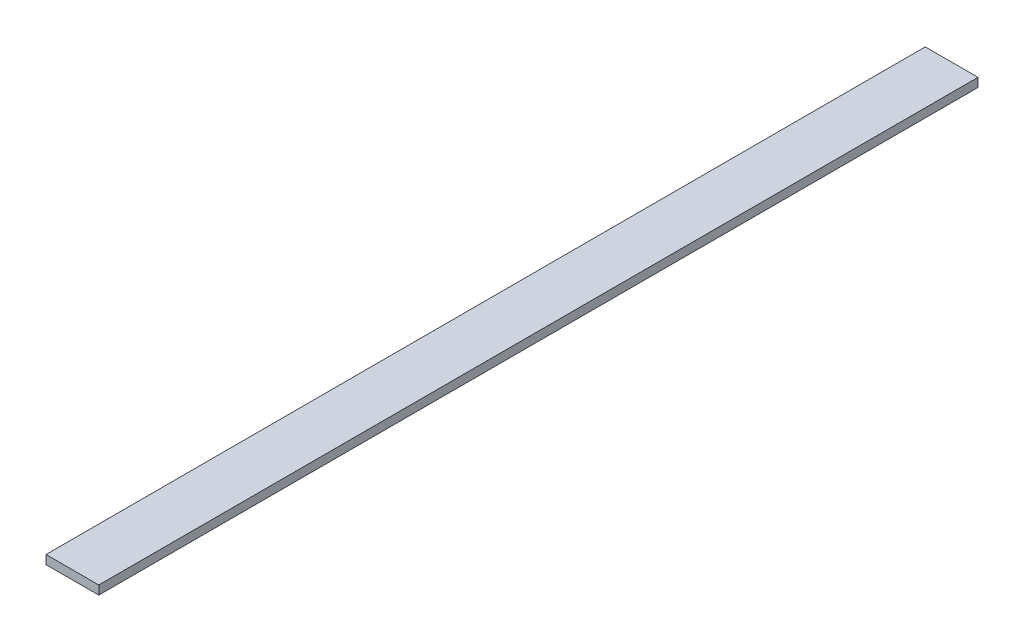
ISO-10303-21;
HEADER;
FILE_DESCRIPTION(('STEP AP214'),'2;1');
FILE_NAME('part.step','',(''),(''),'','','');
FILE_SCHEMA(('AUTOMOTIVE_DESIGN { 1 0 10303 214 1 1 1 1 }'));
ENDSEC;
DATA;
#1=APPLICATION_CONTEXT('core data for automotive mechanical design processes');
#2=APPLICATION_PROTOCOL_DEFINITION('international standard','automotive_design',2000,#1);
#3=PRODUCT_CONTEXT('',#1,'mechanical');
#4=PRODUCT('Part','Part','',(#3));
#5=PRODUCT_RELATED_PRODUCT_CATEGORY('part','',(#4));
#6=PRODUCT_DEFINITION_FORMATION('','',#4);
#7=PRODUCT_DEFINITION_CONTEXT('part definition',#1,'design');
#8=PRODUCT_DEFINITION('design','',#6,#7);
#9=PRODUCT_DEFINITION_SHAPE('','',#8);
#10=(LENGTH_UNIT() NAMED_UNIT(*) SI_UNIT(.MILLI.,.METRE.));
#11=(NAMED_UNIT(*) PLANE_ANGLE_UNIT() SI_UNIT($,.RADIAN.));
#12=(NAMED_UNIT(*) SI_UNIT($,.STERADIAN.) SOLID_ANGLE_UNIT());
#13=UNCERTAINTY_MEASURE_WITH_UNIT(LENGTH_MEASURE(1.E-05),#10,'distance_accuracy_value','');
#14=(GEOMETRIC_REPRESENTATION_CONTEXT(3) GLOBAL_UNCERTAINTY_ASSIGNED_CONTEXT((#13)) GLOBAL_UNIT_ASSIGNED_CONTEXT((#10,
#11,#12)) REPRESENTATION_CONTEXT('',''));
#15=CARTESIAN_POINT('',(0.,0.,0.));
#16=DIRECTION('',(0.,0.,1.));
#17=DIRECTION('',(1.,0.,0.));
#18=AXIS2_PLACEMENT_3D('',#15,#16,#17);
#19=CARTESIAN_POINT('',(15.,0.,0.));
#20=DIRECTION('',(-1.,0.,0.));
#21=DIRECTION('',(0.,0.,1.));
#22=AXIS2_PLACEMENT_3D('',#19,#20,#21);
#23=PLANE('',#22);
#24=DIRECTION('',(0.,-1.,0.));
#25=VECTOR('',#24,1.);
#26=CARTESIAN_POINT('',(15.,2.5,0.));
#27=LINE('',#26,#25);
#28=CARTESIAN_POINT('',(15.,5.,0.));
#29=VERTEX_POINT('',#28);
#30=CARTESIAN_POINT('',(15.,0.,0.));
#31=VERTEX_POINT('',#30);
#32=EDGE_CURVE('E51',#29,#31,#27,.T.);
#33=ORIENTED_EDGE('',*,*,#32,.F.);
#34=DIRECTION('',(0.,0.,-1.));
#35=VECTOR('',#34,1.);
#36=CARTESIAN_POINT('',(15.,5.,250.));
#37=LINE('',#36,#35);
#38=CARTESIAN_POINT('',(15.,5.,500.));
#39=VERTEX_POINT('',#38);
#40=EDGE_CURVE('E66',#39,#29,#37,.T.);
#41=ORIENTED_EDGE('',*,*,#40,.F.);
#42=DIRECTION('',(0.,-1.,0.));
#43=VECTOR('',#42,1.);
#44=CARTESIAN_POINT('',(15.,2.5,500.));
#45=LINE('',#44,#43);
#46=CARTESIAN_POINT('',(15.,0.,500.));
#47=VERTEX_POINT('',#46);
#48=EDGE_CURVE('E18',#39,#47,#45,.T.);
#49=ORIENTED_EDGE('',*,*,#48,.T.);
#50=DIRECTION('',(0.,0.,1.));
#51=VECTOR('',#50,1.);
#52=CARTESIAN_POINT('',(15.,0.,250.));
#53=LINE('',#52,#51);
#54=EDGE_CURVE('E56',#31,#47,#53,.T.);
#55=ORIENTED_EDGE('',*,*,#54,.F.);
#56=EDGE_LOOP('',(#33,#41,#49,#55));
#57=FACE_BOUND('',#56,.T.);
#58=ADVANCED_FACE('F14',(#57),#23,.F.);
#59=CARTESIAN_POINT('',(15.,0.,500.));
#60=DIRECTION('',(0.,0.,-1.));
#61=DIRECTION('',(-1.,0.,0.));
#62=AXIS2_PLACEMENT_3D('',#59,#60,#61);
#63=PLANE('',#62);
#64=DIRECTION('',(-1.,0.,0.));
#65=VECTOR('',#64,1.);
#66=CARTESIAN_POINT('',(0.,0.,500.));
#67=LINE('',#66,#65);
#68=CARTESIAN_POINT('',(-15.,0.,500.));
#69=VERTEX_POINT('',#68);
#70=EDGE_CURVE('E61',#47,#69,#67,.T.);
#71=ORIENTED_EDGE('',*,*,#70,.F.);
#72=ORIENTED_EDGE('',*,*,#48,.F.);
#73=DIRECTION('',(1.,0.,0.));
#74=VECTOR('',#73,1.);
#75=CARTESIAN_POINT('',(0.,5.,500.));
#76=LINE('',#75,#74);
#77=CARTESIAN_POINT('',(-15.,5.,500.));
#78=VERTEX_POINT('',#77);
#79=EDGE_CURVE('E79',#78,#39,#76,.T.);
#80=ORIENTED_EDGE('',*,*,#79,.F.);
#81=DIRECTION('',(0.,-1.,0.));
#82=VECTOR('',#81,1.);
#83=CARTESIAN_POINT('',(-15.,2.5,500.));
#84=LINE('',#83,#82);
#85=EDGE_CURVE('E72',#78,#69,#84,.T.);
#86=ORIENTED_EDGE('',*,*,#85,.T.);
#87=EDGE_LOOP('',(#71,#72,#80,#86));
#88=FACE_BOUND('',#87,.T.);
#89=ADVANCED_FACE('F71',(#88),#63,.F.);
#90=CARTESIAN_POINT('',(-15.,0.,500.));
#91=DIRECTION('',(0.,-1.,0.));
#92=DIRECTION('',(0.,0.,-1.));
#93=AXIS2_PLACEMENT_3D('',#90,#91,#92);
#94=PLANE('',#93);
#95=ORIENTED_EDGE('',*,*,#70,.T.);
#96=DIRECTION('',(0.,0.,-1.));
#97=VECTOR('',#96,1.);
#98=CARTESIAN_POINT('',(-15.,0.,250.));
#99=LINE('',#98,#97);
#100=CARTESIAN_POINT('',(-15.,0.,0.));
#101=VERTEX_POINT('',#100);
#102=EDGE_CURVE('E82',#69,#101,#99,.T.);
#103=ORIENTED_EDGE('',*,*,#102,.T.);
#104=DIRECTION('',(-1.,0.,0.));
#105=VECTOR('',#104,1.);
#106=CARTESIAN_POINT('',(0.,0.,0.));
#107=LINE('',#106,#105);
#108=EDGE_CURVE('E63',#31,#101,#107,.T.);
#109=ORIENTED_EDGE('',*,*,#108,.F.);
#110=ORIENTED_EDGE('',*,*,#54,.T.);
#111=EDGE_LOOP('',(#95,#103,#109,#110));
#112=FACE_BOUND('',#111,.T.);
#113=ADVANCED_FACE('F58',(#112),#94,.T.);
#114=CARTESIAN_POINT('',(15.,0.,0.));
#115=DIRECTION('',(0.,0.,-1.));
#116=DIRECTION('',(-1.,0.,0.));
#117=AXIS2_PLACEMENT_3D('',#114,#115,#116);
#118=PLANE('',#117);
#119=ORIENTED_EDGE('',*,*,#32,.T.);
#120=ORIENTED_EDGE('',*,*,#108,.T.);
#121=DIRECTION('',(0.,1.,0.));
#122=VECTOR('',#121,1.);
#123=CARTESIAN_POINT('',(-15.,2.5,0.));
#124=LINE('',#123,#122);
#125=CARTESIAN_POINT('',(-15.,5.,0.));
#126=VERTEX_POINT('',#125);
#127=EDGE_CURVE('E24',#101,#126,#124,.T.);
#128=ORIENTED_EDGE('',*,*,#127,.T.);
#129=DIRECTION('',(-1.,0.,0.));
#130=VECTOR('',#129,1.);
#131=CARTESIAN_POINT('',(0.,5.,0.));
#132=LINE('',#131,#130);
#133=EDGE_CURVE('E32',#29,#126,#132,.T.);
#134=ORIENTED_EDGE('',*,*,#133,.F.);
#135=EDGE_LOOP('',(#119,#120,#128,#134));
#136=FACE_BOUND('',#135,.T.);
#137=ADVANCED_FACE('F86',(#136),#118,.T.);
#138=CARTESIAN_POINT('',(15.,5.,0.));
#139=DIRECTION('',(0.,1.,0.));
#140=DIRECTION('',(-1.,0.,0.));
#141=AXIS2_PLACEMENT_3D('',#138,#139,#140);
#142=PLANE('',#141);
#143=DIRECTION('',(0.,0.,1.));
#144=VECTOR('',#143,1.);
#145=CARTESIAN_POINT('',(-15.,5.,250.));
#146=LINE('',#145,#144);
#147=EDGE_CURVE('E9',#126,#78,#146,.T.);
#148=ORIENTED_EDGE('',*,*,#147,.T.);
#149=ORIENTED_EDGE('',*,*,#79,.T.);
#150=ORIENTED_EDGE('',*,*,#40,.T.);
#151=ORIENTED_EDGE('',*,*,#133,.T.);
#152=EDGE_LOOP('',(#148,#149,#150,#151));
#153=FACE_BOUND('',#152,.T.);
#154=ADVANCED_FACE('F88',(#153),#142,.T.);
#155=CARTESIAN_POINT('',(-15.,0.,500.));
#156=DIRECTION('',(1.,0.,0.));
#157=DIRECTION('',(0.,0.,-1.));
#158=AXIS2_PLACEMENT_3D('',#155,#156,#157);
#159=PLANE('',#158);
#160=ORIENTED_EDGE('',*,*,#127,.F.);
#161=ORIENTED_EDGE('',*,*,#102,.F.);
#162=ORIENTED_EDGE('',*,*,#85,.F.);
#163=ORIENTED_EDGE('',*,*,#147,.F.);
#164=EDGE_LOOP('',(#160,#161,#162,#163));
#165=FACE_BOUND('',#164,.T.);
#166=ADVANCED_FACE('F16',(#165),#159,.F.);
#167=CLOSED_SHELL('',(#58,#89,#113,#137,#154,#166));
#168=MANIFOLD_SOLID_BREP('B1',#167);
#169=ADVANCED_BREP_SHAPE_REPRESENTATION('',(#18,#168),#14);
#170=SHAPE_DEFINITION_REPRESENTATION(#9,#169);
ENDSEC;
END-ISO-10303-21;
